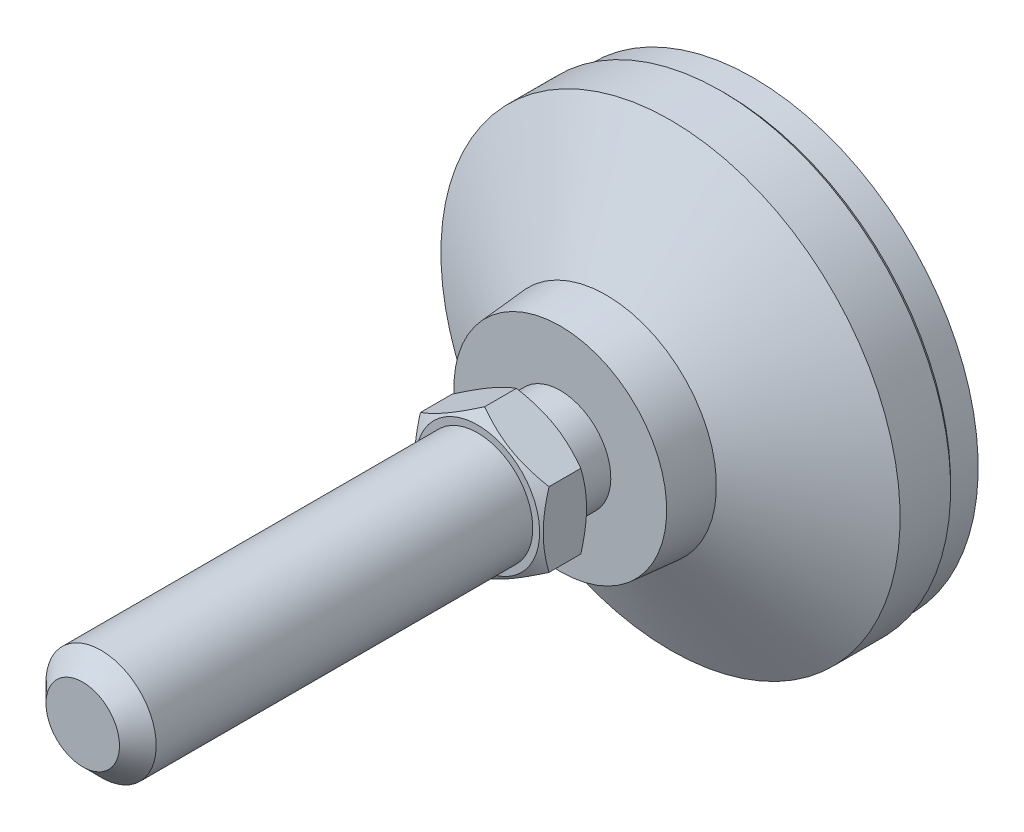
ISO-10303-21;
HEADER;
FILE_DESCRIPTION(('STEP AP214'),'2;1');
FILE_NAME('part.step','',(''),(''),'','','');
FILE_SCHEMA(('AUTOMOTIVE_DESIGN { 1 0 10303 214 1 1 1 1 }'));
ENDSEC;
DATA;
#1=APPLICATION_CONTEXT('core data for automotive mechanical design processes');
#2=APPLICATION_PROTOCOL_DEFINITION('international standard','automotive_design',2000,#1);
#3=PRODUCT_CONTEXT('',#1,'mechanical');
#4=PRODUCT('Part','Part','',(#3));
#5=PRODUCT_RELATED_PRODUCT_CATEGORY('part','',(#4));
#6=PRODUCT_DEFINITION_FORMATION('','',#4);
#7=PRODUCT_DEFINITION_CONTEXT('part definition',#1,'design');
#8=PRODUCT_DEFINITION('design','',#6,#7);
#9=PRODUCT_DEFINITION_SHAPE('','',#8);
#10=(LENGTH_UNIT() NAMED_UNIT(*) SI_UNIT(.MILLI.,.METRE.));
#11=(NAMED_UNIT(*) PLANE_ANGLE_UNIT() SI_UNIT($,.RADIAN.));
#12=(NAMED_UNIT(*) SI_UNIT($,.STERADIAN.) SOLID_ANGLE_UNIT());
#13=UNCERTAINTY_MEASURE_WITH_UNIT(LENGTH_MEASURE(1.E-05),#10,'distance_accuracy_value','');
#14=(GEOMETRIC_REPRESENTATION_CONTEXT(3) GLOBAL_UNCERTAINTY_ASSIGNED_CONTEXT((#13)) GLOBAL_UNIT_ASSIGNED_CONTEXT((#10,
#11,#12)) REPRESENTATION_CONTEXT('',''));
#15=CARTESIAN_POINT('',(0.,0.,0.));
#16=DIRECTION('',(0.,0.,1.));
#17=DIRECTION('',(1.,0.,0.));
#18=AXIS2_PLACEMENT_3D('',#15,#16,#17);
#19=CARTESIAN_POINT('',(0.,0.,1.99999999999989));
#20=DIRECTION('',(0.,0.,-1.));
#21=DIRECTION('',(0.,1.,0.));
#22=AXIS2_PLACEMENT_3D('',#19,#20,#21);
#23=CYLINDRICAL_SURFACE('',#22,5.5);
#24=CARTESIAN_POINT('',(0.,0.,24.9999999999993));
#25=DIRECTION('',(0.,0.,-1.));
#26=DIRECTION('',(0.,1.,0.));
#27=AXIS2_PLACEMENT_3D('',#24,#25,#26);
#28=CIRCLE('',#27,5.5);
#29=CARTESIAN_POINT('',(0.,5.5,24.9999999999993));
#30=VERTEX_POINT('',#29);
#31=EDGE_CURVE('E106',#30,#30,#28,.T.);
#32=ORIENTED_EDGE('',*,*,#31,.T.);
#33=EDGE_LOOP('',(#32));
#34=FACE_BOUND('',#33,.T.);
#35=CARTESIAN_POINT('',(0.,0.,21.));
#36=DIRECTION('',(0.,0.,-1.));
#37=DIRECTION('',(0.,1.,0.));
#38=AXIS2_PLACEMENT_3D('',#35,#36,#37);
#39=CIRCLE('',#38,5.5);
#40=CARTESIAN_POINT('',(0.,5.5,21.));
#41=VERTEX_POINT('',#40);
#42=EDGE_CURVE('E93',#41,#41,#39,.T.);
#43=ORIENTED_EDGE('',*,*,#42,.F.);
#44=EDGE_LOOP('',(#43));
#45=FACE_BOUND('',#44,.T.);
#46=ADVANCED_FACE('F14',(#34,#45),#23,.T.);
#47=CARTESIAN_POINT('',(-5.5,0.,24.9999999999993));
#48=DIRECTION('',(0.,0.,1.));
#49=DIRECTION('',(0.,-1.,0.));
#50=AXIS2_PLACEMENT_3D('',#47,#48,#49);
#51=PLANE('',#50);
#52=CARTESIAN_POINT('',(0.,0.,24.9999999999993));
#53=DIRECTION('',(0.,0.,1.));
#54=DIRECTION('',(0.,-1.,0.));
#55=AXIS2_PLACEMENT_3D('',#52,#53,#54);
#56=CIRCLE('',#55,6.75);
#57=CARTESIAN_POINT('',(0.,-6.75,24.9999999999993));
#58=VERTEX_POINT('',#57);
#59=EDGE_CURVE('E398',#58,#58,#56,.T.);
#60=ORIENTED_EDGE('',*,*,#59,.F.);
#61=EDGE_LOOP('',(#60));
#62=FACE_BOUND('',#61,.T.);
#63=ORIENTED_EDGE('',*,*,#31,.F.);
#64=EDGE_LOOP('',(#63));
#65=FACE_BOUND('',#64,.T.);
#66=ADVANCED_FACE('F143',(#62,#65),#51,.F.);
#67=CARTESIAN_POINT('',(0.,-5.5,21.));
#68=DIRECTION('',(0.,0.,1.));
#69=DIRECTION('',(0.,-1.,0.));
#70=AXIS2_PLACEMENT_3D('',#67,#68,#69);
#71=PLANE('',#70);
#72=ORIENTED_EDGE('',*,*,#42,.T.);
#73=EDGE_LOOP('',(#72));
#74=FACE_BOUND('',#73,.T.);
#75=CARTESIAN_POINT('',(0.,0.,21.));
#76=DIRECTION('',(0.,0.,1.));
#77=DIRECTION('',(0.,-1.,0.));
#78=AXIS2_PLACEMENT_3D('',#75,#76,#77);
#79=CIRCLE('',#78,11.5833333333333);
#80=CARTESIAN_POINT('',(0.,-11.5833333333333,21.));
#81=VERTEX_POINT('',#80);
#82=EDGE_CURVE('E88',#81,#81,#79,.T.);
#83=ORIENTED_EDGE('',*,*,#82,.T.);
#84=EDGE_LOOP('',(#83));
#85=FACE_BOUND('',#84,.T.);
#86=ADVANCED_FACE('F150',(#74,#85),#71,.T.);
#87=CARTESIAN_POINT('',(0.,0.,1.99999999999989));
#88=DIRECTION('',(0.,0.,-1.));
#89=DIRECTION('',(0.,1.,0.));
#90=AXIS2_PLACEMENT_3D('',#87,#88,#89);
#91=CYLINDRICAL_SURFACE('',#90,25.);
#92=CARTESIAN_POINT('',(0.,0.,3.5));
#93=DIRECTION('',(0.,0.,-1.));
#94=DIRECTION('',(0.,1.,0.));
#95=AXIS2_PLACEMENT_3D('',#92,#93,#94);
#96=CIRCLE('',#95,25.);
#97=CARTESIAN_POINT('',(0.,25.,3.5));
#98=VERTEX_POINT('',#97);
#99=EDGE_CURVE('E28',#98,#98,#96,.F.);
#100=ORIENTED_EDGE('',*,*,#99,.T.);
#101=EDGE_LOOP('',(#100));
#102=FACE_BOUND('',#101,.T.);
#103=CARTESIAN_POINT('',(0.,0.,9.));
#104=DIRECTION('',(0.,0.,-1.));
#105=DIRECTION('',(0.,1.,0.));
#106=AXIS2_PLACEMENT_3D('',#103,#104,#105);
#107=CIRCLE('',#106,25.);
#108=CARTESIAN_POINT('',(0.,25.,9.));
#109=VERTEX_POINT('',#108);
#110=EDGE_CURVE('E112',#109,#109,#107,.T.);
#111=ORIENTED_EDGE('',*,*,#110,.T.);
#112=EDGE_LOOP('',(#111));
#113=FACE_BOUND('',#112,.T.);
#114=ADVANCED_FACE('F120',(#102,#113),#91,.T.);
#115=CARTESIAN_POINT('',(0.,0.,16.));
#116=DIRECTION('',(0.,0.,-1.));
#117=DIRECTION('',(0.,1.,0.));
#118=AXIS2_PLACEMENT_3D('',#115,#116,#117);
#119=CONICAL_SURFACE('',#118,11.9999999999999,1.07685495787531);
#120=ORIENTED_EDGE('',*,*,#110,.F.);
#121=EDGE_LOOP('',(#120));
#122=FACE_BOUND('',#121,.T.);
#123=CARTESIAN_POINT('',(0.,0.,16.));
#124=DIRECTION('',(0.,0.,-1.));
#125=DIRECTION('',(0.,1.,0.));
#126=AXIS2_PLACEMENT_3D('',#123,#124,#125);
#127=CIRCLE('',#126,11.9999999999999);
#128=CARTESIAN_POINT('',(0.,11.9999999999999,16.));
#129=VERTEX_POINT('',#128);
#130=EDGE_CURVE('E109',#129,#129,#127,.T.);
#131=ORIENTED_EDGE('',*,*,#130,.T.);
#132=EDGE_LOOP('',(#131));
#133=FACE_BOUND('',#132,.T.);
#134=ADVANCED_FACE('F158',(#122,#133),#119,.T.);
#135=CARTESIAN_POINT('',(0.,0.,22.));
#136=DIRECTION('',(0.,0.,-1.));
#137=DIRECTION('',(0.,1.,0.));
#138=AXIS2_PLACEMENT_3D('',#135,#136,#137);
#139=CONICAL_SURFACE('',#138,11.5,0.0831412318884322);
#140=ORIENTED_EDGE('',*,*,#130,.F.);
#141=EDGE_LOOP('',(#140));
#142=FACE_BOUND('',#141,.T.);
#143=ORIENTED_EDGE('',*,*,#82,.F.);
#144=EDGE_LOOP('',(#143));
#145=FACE_BOUND('',#144,.T.);
#146=ADVANCED_FACE('F126',(#142,#145),#139,.T.);
#147=CARTESIAN_POINT('',(0.,0.,3.));
#148=DIRECTION('',(0.,0.,1.));
#149=DIRECTION('',(0.,-1.,0.));
#150=AXIS2_PLACEMENT_3D('',#147,#148,#149);
#151=CONICAL_SURFACE('',#150,24.5,0.785398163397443);
#152=ORIENTED_EDGE('',*,*,#99,.F.);
#153=EDGE_LOOP('',(#152));
#154=FACE_BOUND('',#153,.T.);
#155=CARTESIAN_POINT('',(0.,0.,3.));
#156=DIRECTION('',(0.,0.,-1.));
#157=DIRECTION('',(0.,1.,0.));
#158=AXIS2_PLACEMENT_3D('',#155,#156,#157);
#159=CIRCLE('',#158,24.5);
#160=CARTESIAN_POINT('',(0.,24.5,3.));
#161=VERTEX_POINT('',#160);
#162=EDGE_CURVE('E114',#161,#161,#159,.T.);
#163=ORIENTED_EDGE('',*,*,#162,.F.);
#164=EDGE_LOOP('',(#163));
#165=FACE_BOUND('',#164,.T.);
#166=ADVANCED_FACE('F16',(#154,#165),#151,.T.);
#167=CARTESIAN_POINT('',(0.,0.,0.));
#168=DIRECTION('',(0.,0.,1.));
#169=DIRECTION('',(0.,-1.,0.));
#170=AXIS2_PLACEMENT_3D('',#167,#168,#169);
#171=CYLINDRICAL_SURFACE('',#170,24.5);
#172=CARTESIAN_POINT('',(0.,0.,0.));
#173=DIRECTION('',(0.,0.,-1.));
#174=DIRECTION('',(0.,1.,0.));
#175=AXIS2_PLACEMENT_3D('',#172,#173,#174);
#176=CIRCLE('',#175,24.5);
#177=CARTESIAN_POINT('',(0.,24.5,0.));
#178=VERTEX_POINT('',#177);
#179=EDGE_CURVE('E264',#178,#178,#176,.T.);
#180=ORIENTED_EDGE('',*,*,#179,.F.);
#181=EDGE_LOOP('',(#180));
#182=FACE_BOUND('',#181,.T.);
#183=ORIENTED_EDGE('',*,*,#162,.T.);
#184=EDGE_LOOP('',(#183));
#185=FACE_BOUND('',#184,.T.);
#186=ADVANCED_FACE('F125',(#182,#185),#171,.T.);
#187=CARTESIAN_POINT('',(0.,0.,0.));
#188=DIRECTION('',(0.,0.,-1.));
#189=DIRECTION('',(0.,1.,0.));
#190=AXIS2_PLACEMENT_3D('',#187,#188,#189);
#191=PLANE('',#190);
#192=ORIENTED_EDGE('',*,*,#179,.T.);
#193=EDGE_LOOP('',(#192));
#194=FACE_BOUND('',#193,.T.);
#195=ADVANCED_FACE('F130',(#194),#191,.T.);
#196=CARTESIAN_POINT('',(0.,0.,24.9999999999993));
#197=DIRECTION('',(0.,0.,1.));
#198=DIRECTION('',(0.,-1.,0.));
#199=AXIS2_PLACEMENT_3D('',#196,#197,#198);
#200=CONICAL_SURFACE('',#199,6.75,1.0471975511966);
#201=CARTESIAN_POINT('',(0.000200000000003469,-8.0830192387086,25.7696190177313));
#202=CARTESIAN_POINT('',(-0.153667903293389,-7.99418356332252,25.7183374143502));
#203=CARTESIAN_POINT('',(-0.308109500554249,-7.90501666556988,25.6693831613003));
#204=CARTESIAN_POINT('',(-0.618246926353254,-7.72595873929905,25.5767703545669));
#205=CARTESIAN_POINT('',(-0.773943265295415,-7.63606741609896,25.5331140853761));
#206=CARTESIAN_POINT('',(-1.24352516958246,-7.36495417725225,25.4109491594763));
#207=CARTESIAN_POINT('',(-1.5592643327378,-7.18266208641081,25.3414631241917));
#208=CARTESIAN_POINT('',(-2.03176224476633,-6.90986528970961,25.2599825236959));
#209=CARTESIAN_POINT('',(-2.18710922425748,-6.82017566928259,25.2367710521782));
#210=CARTESIAN_POINT('',(-2.49850511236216,-6.64039116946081,25.1978487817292));
#211=CARTESIAN_POINT('',(-2.65455395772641,-6.55029632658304,25.1821373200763));
#212=CARTESIAN_POINT('',(-2.96692267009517,-6.36995016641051,25.1586154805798));
#213=CARTESIAN_POINT('',(-3.12324202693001,-6.27969914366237,25.1507961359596));
#214=CARTESIAN_POINT('',(-3.43601650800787,-6.09911871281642,25.1432178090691));
#215=CARTESIAN_POINT('',(-3.59247162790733,-6.00878930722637,25.1434585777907));
#216=CARTESIAN_POINT('',(-4.02110687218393,-5.76131663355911,25.1551972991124));
#217=CARTESIAN_POINT('',(-4.2931466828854,-5.60425437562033,25.1749033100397));
#218=CARTESIAN_POINT('',(-4.83541944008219,-5.29117305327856,25.2373910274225));
#219=CARTESIAN_POINT('',(-5.10565047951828,-5.13515508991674,25.2801940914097));
#220=CARTESIAN_POINT('',(-5.64901454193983,-4.82144370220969,25.3871892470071));
#221=CARTESIAN_POINT('',(-5.92207900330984,-4.6637898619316,25.4518346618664));
#222=CARTESIAN_POINT('',(-6.46413578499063,-4.35083323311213,25.5985536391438));
#223=CARTESIAN_POINT('',(-6.73313504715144,-4.19552643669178,25.6805927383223));
#224=CARTESIAN_POINT('',(-7.0002,-4.04133641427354,25.7696190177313));
#225=B_SPLINE_CURVE_WITH_KNOTS('',3,(#201,#202,#203,#204,#205,#206,#207,#208,#209,#210,#211,
#212,#213,#214,#215,#216,#217,#218,#219,#220,#221,#222,#223,#224),.UNSPECIFIED.,.F.,.F.,(4,2,2,
2,2,2,2,2,2,2,2,4),(0.,0.554727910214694,1.10969417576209,2.2219327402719,2.76443041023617,
3.30688013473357,3.8487128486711,4.39052882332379,5.33376515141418,6.27787517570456,
7.2429241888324,8.20607866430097),.UNSPECIFIED.);
#226=CARTESIAN_POINT('',(0.,-8.08290376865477,25.7695523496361));
#227=VERTEX_POINT('',#226);
#228=CARTESIAN_POINT('',(-7.,-4.04145188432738,25.769552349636));
#229=VERTEX_POINT('',#228);
#230=EDGE_CURVE('E73',#227,#229,#225,.T.);
#231=ORIENTED_EDGE('',*,*,#230,.T.);
#232=CARTESIAN_POINT('',(-7.,10.8630125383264,28.5640080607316));
#233=CARTESIAN_POINT('',(-7.,10.5572155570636,28.4156402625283));
#234=CARTESIAN_POINT('',(-7.,10.2507173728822,28.2686929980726));
#235=CARTESIAN_POINT('',(-7.,9.63594571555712,27.9784383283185));
#236=CARTESIAN_POINT('',(-7.,9.32767197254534,27.8351314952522));
#237=CARTESIAN_POINT('',(-7.,8.70739146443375,27.5522370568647));
#238=CARTESIAN_POINT('',(-7.,8.39537351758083,27.412673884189));
#239=CARTESIAN_POINT('',(-7.,7.76885850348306,27.1392493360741));
#240=CARTESIAN_POINT('',(-7.,7.45436155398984,27.0053876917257));
#241=CARTESIAN_POINT('',(-7.,6.81221025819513,26.7406756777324));
#242=CARTESIAN_POINT('',(-7.,6.4844582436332,26.6100609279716));
#243=CARTESIAN_POINT('',(-7.,5.82512318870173,26.3586994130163));
#244=CARTESIAN_POINT('',(-7.,5.49353972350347,26.2379537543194));
#245=CARTESIAN_POINT('',(-7.,4.82662851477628,26.0094952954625));
#246=CARTESIAN_POINT('',(-7.,4.4913098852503,25.9017561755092));
#247=CARTESIAN_POINT('',(-7.,3.81587463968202,25.7027618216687));
#248=CARTESIAN_POINT('',(-7.,3.47575956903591,25.6115014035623));
#249=CARTESIAN_POINT('',(-7.,2.79237059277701,25.450330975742));
#250=CARTESIAN_POINT('',(-7.,2.44912480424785,25.3803049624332));
#251=CARTESIAN_POINT('',(-7.,1.9311246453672,25.294219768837));
#252=CARTESIAN_POINT('',(-7.,1.75792335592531,25.2686825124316));
#253=CARTESIAN_POINT('',(-7.,1.41065742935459,25.2244266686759));
#254=CARTESIAN_POINT('',(-7.,1.23659287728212,25.205707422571));
#255=CARTESIAN_POINT('',(-7.,0.890110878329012,25.175695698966));
#256=CARTESIAN_POINT('',(-7.,0.7177015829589,25.1643094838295));
#257=CARTESIAN_POINT('',(-7.,0.372555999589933,25.1488383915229));
#258=CARTESIAN_POINT('',(-7.,0.199819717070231,25.1447533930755));
#259=CARTESIAN_POINT('',(-7.,-0.145671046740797,25.143982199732));
#260=CARTESIAN_POINT('',(-7.,-0.318425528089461,25.147296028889));
#261=CARTESIAN_POINT('',(-7.,-0.663641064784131,25.1612414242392));
#262=CARTESIAN_POINT('',(-7.,-0.836102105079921,25.1718733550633));
#263=CARTESIAN_POINT('',(-7.,-1.2503567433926,25.205975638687));
#264=CARTESIAN_POINT('',(-7.,-1.49187154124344,25.232905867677));
#265=CARTESIAN_POINT('',(-7.,-1.97310201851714,25.2996504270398));
#266=CARTESIAN_POINT('',(-7.,-2.21281744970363,25.3394665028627));
#267=CARTESIAN_POINT('',(-7.,-2.92899417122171,25.4761316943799));
#268=CARTESIAN_POINT('',(-7.,-3.40221781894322,25.5901727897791));
#269=CARTESIAN_POINT('',(-7.,-4.10982698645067,25.7878531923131));
#270=CARTESIAN_POINT('',(-7.,-4.34788466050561,25.8591031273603));
#271=CARTESIAN_POINT('',(-7.,-4.82168769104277,26.008984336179));
#272=CARTESIAN_POINT('',(-7.,-5.05743303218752,26.087615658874));
#273=CARTESIAN_POINT('',(-7.,-5.52668595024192,26.2509995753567));
#274=CARTESIAN_POINT('',(-7.,-5.7601942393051,26.3357501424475));
#275=CARTESIAN_POINT('',(-7.,-6.22527733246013,26.5103772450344));
#276=CARTESIAN_POINT('',(-7.,-6.45685215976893,26.6002537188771));
#277=CARTESIAN_POINT('',(-7.,-7.00565643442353,26.8191269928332));
#278=CARTESIAN_POINT('',(-7.,-7.32211612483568,26.950050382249));
#279=CARTESIAN_POINT('',(-7.,-7.952326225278,27.218281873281));
#280=CARTESIAN_POINT('',(-7.,-8.26607646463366,27.3555903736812));
#281=CARTESIAN_POINT('',(-7.,-8.89136965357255,27.6353019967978));
#282=CARTESIAN_POINT('',(-7.,-9.20291213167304,27.7777061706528));
#283=CARTESIAN_POINT('',(-7.,-9.82410849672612,28.0665831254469));
#284=CARTESIAN_POINT('',(-7.,-10.1337623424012,28.2130559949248));
#285=CARTESIAN_POINT('',(-7.,-10.7518223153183,28.5094602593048));
#286=CARTESIAN_POINT('',(-7.,-11.0602267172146,28.6593952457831));
#287=CARTESIAN_POINT('',(-7.,-11.6757024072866,28.9619793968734));
#288=CARTESIAN_POINT('',(-7.,-11.982773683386,29.114628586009));
#289=CARTESIAN_POINT('',(-7.,-12.9022245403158,29.5758799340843));
#290=CARTESIAN_POINT('',(-7.,-13.5129259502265,29.8878268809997));
#291=CARTESIAN_POINT('',(-7.,-14.6795242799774,30.4913100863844));
#292=CARTESIAN_POINT('',(-7.,-15.2356847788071,30.782339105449));
#293=CARTESIAN_POINT('',(-7.,-16.3459435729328,31.3683501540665));
#294=CARTESIAN_POINT('',(-7.,-16.9000417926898,31.6633323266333));
#295=CARTESIAN_POINT('',(-7.,-18.0052310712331,32.2555539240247));
#296=CARTESIAN_POINT('',(-7.,-18.5563261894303,32.5527857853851));
#297=CARTESIAN_POINT('',(-7.,-19.6571994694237,33.1496062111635));
#298=CARTESIAN_POINT('',(-7.,-20.2069777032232,33.4491946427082));
#299=CARTESIAN_POINT('',(-7.,-20.7562720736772,33.7496616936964));
#300=B_SPLINE_CURVE_WITH_KNOTS('',3,(#232,#233,#234,#235,#236,#237,#238,#239,#240,#241,#242,
#243,#244,#245,#246,#247,#248,#249,#250,#251,#252,#253,#254,#255,#256,#257,#258,#259,#260,#261,
#262,#263,#264,#265,#266,#267,#268,#269,#270,#271,#272,#273,#274,#275,#276,#277,#278,#279,#280,
#281,#282,#283,#284,#285,#286,#287,#288,#289,#290,#291,#292,#293,#294,#295,#296,#297,#298,#299),
.UNSPECIFIED.,.F.,.F.,(4,2,2,2,2,2,2,2,2,2,2,2,2,2,2,2,2,2,2,2,2,2,2,2,2,2,2,2,2,2,2,2,2,4),(0.,
1.01968058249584,2.03952046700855,3.06490037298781,4.09023186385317,5.14856701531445,
6.20702066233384,7.26329520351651,8.31923685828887,9.36930142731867,9.89440977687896,
10.4194673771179,10.9376725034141,11.4558690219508,11.974067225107,12.4922912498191,
13.2209144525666,13.9496363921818,15.407884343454,16.1532966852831,16.8987139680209,
17.6438854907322,18.3890480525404,19.4163717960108,20.4437597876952,21.4713609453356,
22.4989844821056,23.5277267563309,24.5564783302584,26.6136989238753,28.4967942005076,
30.3799577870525,32.2583748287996,34.1366867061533),.UNSPECIFIED.);
#301=CARTESIAN_POINT('',(-7.,4.04145188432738,25.769552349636));
#302=VERTEX_POINT('',#301);
#303=EDGE_CURVE('E81',#229,#302,#300,.F.);
#304=ORIENTED_EDGE('',*,*,#303,.T.);
#305=CARTESIAN_POINT('',(-7.0002,4.04133641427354,25.7696190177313));
#306=CARTESIAN_POINT('',(-6.84633209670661,4.13017208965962,25.7183374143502));
#307=CARTESIAN_POINT('',(-6.69189049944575,4.21933898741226,25.6693831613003));
#308=CARTESIAN_POINT('',(-6.38175307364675,4.39839691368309,25.5767703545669));
#309=CARTESIAN_POINT('',(-6.22605673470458,4.48828823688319,25.5331140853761));
#310=CARTESIAN_POINT('',(-5.75647483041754,4.75940147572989,25.4109491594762));
#311=CARTESIAN_POINT('',(-5.4407356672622,4.94169356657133,25.3414631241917));
#312=CARTESIAN_POINT('',(-4.96823775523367,5.21449036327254,25.2599825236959));
#313=CARTESIAN_POINT('',(-4.81289077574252,5.30417998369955,25.2367710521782));
#314=CARTESIAN_POINT('',(-4.50149488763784,5.48396448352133,25.1978487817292));
#315=CARTESIAN_POINT('',(-4.34544604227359,5.57405932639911,25.1821373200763));
#316=CARTESIAN_POINT('',(-4.03307732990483,5.75440548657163,25.1586154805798));
#317=CARTESIAN_POINT('',(-3.87675797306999,5.84465650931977,25.1507961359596));
#318=CARTESIAN_POINT('',(-3.56398349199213,6.02523694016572,25.1432178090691));
#319=CARTESIAN_POINT('',(-3.40752837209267,6.11556634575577,25.1434585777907));
#320=CARTESIAN_POINT('',(-2.97889312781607,6.36303901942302,25.1551972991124));
#321=CARTESIAN_POINT('',(-2.7068533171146,6.52010127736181,25.1749033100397));
#322=CARTESIAN_POINT('',(-2.16458055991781,6.83318259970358,25.2373910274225));
#323=CARTESIAN_POINT('',(-1.89434952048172,6.9892005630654,25.2801940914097));
#324=CARTESIAN_POINT('',(-1.35098545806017,7.30291195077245,25.3871892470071));
#325=CARTESIAN_POINT('',(-1.07792099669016,7.46056579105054,25.4518346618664));
#326=CARTESIAN_POINT('',(-0.535864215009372,7.77352241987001,25.5985536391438));
#327=CARTESIAN_POINT('',(-0.266864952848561,7.92882921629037,25.6805927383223));
#328=CARTESIAN_POINT('',(0.000199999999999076,8.0830192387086,25.7696190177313));
#329=B_SPLINE_CURVE_WITH_KNOTS('',3,(#305,#306,#307,#308,#309,#310,#311,#312,#313,#314,#315,
#316,#317,#318,#319,#320,#321,#322,#323,#324,#325,#326,#327,#328),.UNSPECIFIED.,.F.,.F.,(4,2,2,
2,2,2,2,2,2,2,2,4),(0.,0.554727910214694,1.10969417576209,2.2219327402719,2.76443041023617,
3.30688013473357,3.84871284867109,4.39052882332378,5.33376515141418,6.27787517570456,
7.2429241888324,8.20607866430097),.UNSPECIFIED.);
#330=CARTESIAN_POINT('',(0.,8.08290376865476,25.769552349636));
#331=VERTEX_POINT('',#330);
#332=EDGE_CURVE('E198',#302,#331,#329,.T.);
#333=ORIENTED_EDGE('',*,*,#332,.T.);
#334=CARTESIAN_POINT('',(-0.000200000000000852,8.0830192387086,25.7696190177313));
#335=CARTESIAN_POINT('',(0.15366790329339,7.99418356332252,25.7183374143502));
#336=CARTESIAN_POINT('',(0.308109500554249,7.90501666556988,25.6693831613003));
#337=CARTESIAN_POINT('',(0.618246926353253,7.72595873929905,25.5767703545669));
#338=CARTESIAN_POINT('',(0.773943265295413,7.63606741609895,25.5331140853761));
#339=CARTESIAN_POINT('',(1.24352516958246,7.36495417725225,25.4109491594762));
#340=CARTESIAN_POINT('',(1.5592643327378,7.18266208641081,25.3414631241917));
#341=CARTESIAN_POINT('',(2.03176224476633,6.9098652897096,25.2599825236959));
#342=CARTESIAN_POINT('',(2.18710922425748,6.82017566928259,25.2367710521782));
#343=CARTESIAN_POINT('',(2.49850511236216,6.64039116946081,25.1978487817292));
#344=CARTESIAN_POINT('',(2.6545539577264,6.55029632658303,25.1821373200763));
#345=CARTESIAN_POINT('',(2.96692267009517,6.36995016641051,25.1586154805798));
#346=CARTESIAN_POINT('',(3.12324202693,6.27969914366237,25.1507961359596));
#347=CARTESIAN_POINT('',(3.43601650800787,6.09911871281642,25.1432178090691));
#348=CARTESIAN_POINT('',(3.59247162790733,6.00878930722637,25.1434585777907));
#349=CARTESIAN_POINT('',(4.02110687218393,5.76131663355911,25.1551972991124));
#350=CARTESIAN_POINT('',(4.29314668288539,5.60425437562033,25.1749033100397));
#351=CARTESIAN_POINT('',(4.83541944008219,5.29117305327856,25.2373910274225));
#352=CARTESIAN_POINT('',(5.10565047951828,5.13515508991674,25.2801940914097));
#353=CARTESIAN_POINT('',(5.64901454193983,4.82144370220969,25.3871892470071));
#354=CARTESIAN_POINT('',(5.92207900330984,4.66378986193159,25.4518346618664));
#355=CARTESIAN_POINT('',(6.46413578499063,4.35083323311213,25.5985536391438));
#356=CARTESIAN_POINT('',(6.73313504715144,4.19552643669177,25.6805927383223));
#357=CARTESIAN_POINT('',(7.0002,4.04133641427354,25.7696190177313));
#358=B_SPLINE_CURVE_WITH_KNOTS('',3,(#334,#335,#336,#337,#338,#339,#340,#341,#342,#343,#344,
#345,#346,#347,#348,#349,#350,#351,#352,#353,#354,#355,#356,#357),.UNSPECIFIED.,.F.,.F.,(4,2,2,
2,2,2,2,2,2,2,2,4),(0.,0.554727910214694,1.10969417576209,2.2219327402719,2.76443041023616,
3.30688013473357,3.84871284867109,4.39052882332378,5.33376515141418,6.27787517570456,
7.2429241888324,8.20607866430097),.UNSPECIFIED.);
#359=CARTESIAN_POINT('',(7.,4.04145188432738,25.769552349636));
#360=VERTEX_POINT('',#359);
#361=EDGE_CURVE('E227',#331,#360,#358,.T.);
#362=ORIENTED_EDGE('',*,*,#361,.T.);
#363=CARTESIAN_POINT('',(7.,10.8630125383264,28.5640080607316));
#364=CARTESIAN_POINT('',(7.,10.5572155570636,28.4156402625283));
#365=CARTESIAN_POINT('',(7.,10.2507173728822,28.2686929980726));
#366=CARTESIAN_POINT('',(7.,9.63594571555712,27.9784383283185));
#367=CARTESIAN_POINT('',(7.,9.32767197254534,27.8351314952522));
#368=CARTESIAN_POINT('',(7.,8.70739146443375,27.5522370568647));
#369=CARTESIAN_POINT('',(7.,8.39537351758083,27.412673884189));
#370=CARTESIAN_POINT('',(7.,7.76885850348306,27.1392493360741));
#371=CARTESIAN_POINT('',(7.,7.45436155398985,27.0053876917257));
#372=CARTESIAN_POINT('',(7.,6.81221025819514,26.7406756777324));
#373=CARTESIAN_POINT('',(7.,6.48445824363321,26.6100609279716));
#374=CARTESIAN_POINT('',(7.,5.82512318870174,26.3586994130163));
#375=CARTESIAN_POINT('',(7.,5.49353972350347,26.2379537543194));
#376=CARTESIAN_POINT('',(7.,4.82662851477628,26.0094952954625));
#377=CARTESIAN_POINT('',(7.,4.49130988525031,25.9017561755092));
#378=CARTESIAN_POINT('',(7.,3.81587463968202,25.7027618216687));
#379=CARTESIAN_POINT('',(7.,3.47575956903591,25.6115014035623));
#380=CARTESIAN_POINT('',(7.,2.79237059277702,25.450330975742));
#381=CARTESIAN_POINT('',(7.,2.44912480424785,25.3803049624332));
#382=CARTESIAN_POINT('',(7.,1.93112464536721,25.294219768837));
#383=CARTESIAN_POINT('',(7.,1.75792335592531,25.2686825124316));
#384=CARTESIAN_POINT('',(7.,1.41065742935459,25.2244266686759));
#385=CARTESIAN_POINT('',(7.,1.23659287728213,25.205707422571));
#386=CARTESIAN_POINT('',(7.,0.890110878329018,25.175695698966));
#387=CARTESIAN_POINT('',(7.,0.717701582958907,25.1643094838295));
#388=CARTESIAN_POINT('',(7.,0.37255599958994,25.1488383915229));
#389=CARTESIAN_POINT('',(7.,0.199819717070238,25.1447533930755));
#390=CARTESIAN_POINT('',(7.,-0.145671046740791,25.143982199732));
#391=CARTESIAN_POINT('',(7.,-0.318425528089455,25.147296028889));
#392=CARTESIAN_POINT('',(7.,-0.663641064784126,25.1612414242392));
#393=CARTESIAN_POINT('',(7.,-0.836102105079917,25.1718733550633));
#394=CARTESIAN_POINT('',(7.,-1.25035674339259,25.205975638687));
#395=CARTESIAN_POINT('',(7.,-1.49187154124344,25.232905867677));
#396=CARTESIAN_POINT('',(7.,-1.97310201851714,25.2996504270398));
#397=CARTESIAN_POINT('',(7.,-2.21281744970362,25.3394665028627));
#398=CARTESIAN_POINT('',(7.,-2.92899417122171,25.4761316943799));
#399=CARTESIAN_POINT('',(7.,-3.40221781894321,25.5901727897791));
#400=CARTESIAN_POINT('',(7.,-4.10982698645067,25.7878531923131));
#401=CARTESIAN_POINT('',(7.,-4.3478846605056,25.8591031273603));
#402=CARTESIAN_POINT('',(7.,-4.82168769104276,26.008984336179));
#403=CARTESIAN_POINT('',(7.,-5.05743303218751,26.087615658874));
#404=CARTESIAN_POINT('',(7.,-5.52668595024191,26.2509995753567));
#405=CARTESIAN_POINT('',(7.,-5.76019423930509,26.3357501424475));
#406=CARTESIAN_POINT('',(7.,-6.22527733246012,26.5103772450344));
#407=CARTESIAN_POINT('',(7.,-6.45685215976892,26.6002537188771));
#408=CARTESIAN_POINT('',(7.,-7.00565643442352,26.8191269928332));
#409=CARTESIAN_POINT('',(7.,-7.32211612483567,26.950050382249));
#410=CARTESIAN_POINT('',(7.,-7.95232622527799,27.218281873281));
#411=CARTESIAN_POINT('',(7.,-8.26607646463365,27.3555903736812));
#412=CARTESIAN_POINT('',(7.,-8.89136965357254,27.6353019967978));
#413=CARTESIAN_POINT('',(7.,-9.20291213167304,27.7777061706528));
#414=CARTESIAN_POINT('',(7.,-9.82410849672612,28.0665831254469));
#415=CARTESIAN_POINT('',(7.,-10.1337623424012,28.2130559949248));
#416=CARTESIAN_POINT('',(7.,-10.7518223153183,28.5094602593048));
#417=CARTESIAN_POINT('',(7.,-11.0602267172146,28.6593952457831));
#418=CARTESIAN_POINT('',(7.,-11.6757024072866,28.9619793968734));
#419=CARTESIAN_POINT('',(7.,-11.982773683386,29.114628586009));
#420=CARTESIAN_POINT('',(7.,-12.9022245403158,29.5758799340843));
#421=CARTESIAN_POINT('',(7.,-13.5129259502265,29.8878268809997));
#422=CARTESIAN_POINT('',(7.,-14.6795242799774,30.4913100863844));
#423=CARTESIAN_POINT('',(7.,-15.2356847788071,30.782339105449));
#424=CARTESIAN_POINT('',(7.,-16.3459435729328,31.3683501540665));
#425=CARTESIAN_POINT('',(7.,-16.9000417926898,31.6633323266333));
#426=CARTESIAN_POINT('',(7.,-18.0052310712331,32.2555539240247));
#427=CARTESIAN_POINT('',(7.,-18.5563261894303,32.5527857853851));
#428=CARTESIAN_POINT('',(7.,-19.6571994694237,33.1496062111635));
#429=CARTESIAN_POINT('',(7.,-20.2069777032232,33.4491946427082));
#430=CARTESIAN_POINT('',(7.,-20.7562720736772,33.7496616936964));
#431=B_SPLINE_CURVE_WITH_KNOTS('',3,(#363,#364,#365,#366,#367,#368,#369,#370,#371,#372,#373,
#374,#375,#376,#377,#378,#379,#380,#381,#382,#383,#384,#385,#386,#387,#388,#389,#390,#391,#392,
#393,#394,#395,#396,#397,#398,#399,#400,#401,#402,#403,#404,#405,#406,#407,#408,#409,#410,#411,
#412,#413,#414,#415,#416,#417,#418,#419,#420,#421,#422,#423,#424,#425,#426,#427,#428,#429,#430),
.UNSPECIFIED.,.F.,.F.,(4,2,2,2,2,2,2,2,2,2,2,2,2,2,2,2,2,2,2,2,2,2,2,2,2,2,2,2,2,2,2,2,2,4),(0.,
1.01968058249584,2.03952046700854,3.06490037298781,4.09023186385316,5.14856701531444,
6.20702066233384,7.2632952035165,8.31923685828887,9.36930142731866,9.89440977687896,
10.4194673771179,10.9376725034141,11.4558690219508,11.974067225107,12.4922912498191,
13.2209144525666,13.9496363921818,15.407884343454,16.1532966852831,16.8987139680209,
17.6438854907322,18.3890480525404,19.4163717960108,20.4437597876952,21.4713609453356,
22.4989844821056,23.5277267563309,24.5564783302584,26.6136989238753,28.4967942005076,
30.3799577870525,32.2583748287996,34.1366867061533),.UNSPECIFIED.);
#432=CARTESIAN_POINT('',(7.,-4.04145188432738,25.769552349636));
#433=VERTEX_POINT('',#432);
#434=EDGE_CURVE('E34',#360,#433,#431,.T.);
#435=ORIENTED_EDGE('',*,*,#434,.T.);
#436=CARTESIAN_POINT('',(7.0002,-4.04133641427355,25.7696190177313));
#437=CARTESIAN_POINT('',(6.84633209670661,-4.13017208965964,25.7183374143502));
#438=CARTESIAN_POINT('',(6.69189049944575,-4.21933898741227,25.6693831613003));
#439=CARTESIAN_POINT('',(6.38175307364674,-4.3983969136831,25.5767703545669));
#440=CARTESIAN_POINT('',(6.22605673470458,-4.4882882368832,25.5331140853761));
#441=CARTESIAN_POINT('',(5.75647483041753,-4.7594014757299,25.4109491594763));
#442=CARTESIAN_POINT('',(5.4407356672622,-4.94169356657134,25.3414631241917));
#443=CARTESIAN_POINT('',(4.96823775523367,-5.21449036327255,25.2599825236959));
#444=CARTESIAN_POINT('',(4.81289077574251,-5.30417998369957,25.2367710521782));
#445=CARTESIAN_POINT('',(4.50149488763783,-5.48396448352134,25.1978487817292));
#446=CARTESIAN_POINT('',(4.34544604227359,-5.57405932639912,25.1821373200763));
#447=CARTESIAN_POINT('',(4.03307732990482,-5.75440548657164,25.1586154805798));
#448=CARTESIAN_POINT('',(3.87675797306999,-5.84465650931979,25.1507961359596));
#449=CARTESIAN_POINT('',(3.56398349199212,-6.02523694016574,25.1432178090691));
#450=CARTESIAN_POINT('',(3.40752837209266,-6.11556634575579,25.1434585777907));
#451=CARTESIAN_POINT('',(2.97889312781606,-6.36303901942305,25.1551972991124));
#452=CARTESIAN_POINT('',(2.7068533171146,-6.52010127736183,25.1749033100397));
#453=CARTESIAN_POINT('',(2.1645805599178,-6.8331825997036,25.2373910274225));
#454=CARTESIAN_POINT('',(1.89434952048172,-6.98920056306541,25.2801940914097));
#455=CARTESIAN_POINT('',(1.35098545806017,-7.30291195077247,25.3871892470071));
#456=CARTESIAN_POINT('',(1.07792099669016,-7.46056579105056,25.4518346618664));
#457=CARTESIAN_POINT('',(0.535864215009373,-7.77352241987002,25.5985536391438));
#458=CARTESIAN_POINT('',(0.266864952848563,-7.92882921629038,25.6805927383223));
#459=CARTESIAN_POINT('',(-0.00019999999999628,-8.08301923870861,25.7696190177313));
#460=B_SPLINE_CURVE_WITH_KNOTS('',3,(#436,#437,#438,#439,#440,#441,#442,#443,#444,#445,#446,
#447,#448,#449,#450,#451,#452,#453,#454,#455,#456,#457,#458,#459),.UNSPECIFIED.,.F.,.F.,(4,2,2,
2,2,2,2,2,2,2,2,4),(0.,0.554727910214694,1.10969417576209,2.2219327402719,2.76443041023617,
3.30688013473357,3.8487128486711,4.39052882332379,5.33376515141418,6.27787517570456,
7.24292418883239,8.20607866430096),.UNSPECIFIED.);
#461=EDGE_CURVE('E9',#433,#227,#460,.T.);
#462=ORIENTED_EDGE('',*,*,#461,.T.);
#463=EDGE_LOOP('',(#231,#304,#333,#362,#435,#462));
#464=FACE_BOUND('',#463,.T.);
#465=ORIENTED_EDGE('',*,*,#59,.T.);
#466=EDGE_LOOP('',(#465));
#467=FACE_BOUND('',#466,.T.);
#468=ADVANCED_FACE('F71',(#464,#467),#200,.T.);
#469=CARTESIAN_POINT('',(-3.9999999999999,0.,73.));
#470=DIRECTION('',(0.,0.,-1.));
#471=DIRECTION('',(0.,1.,0.));
#472=AXIS2_PLACEMENT_3D('',#469,#470,#471);
#473=PLANE('',#472);
#474=CARTESIAN_POINT('',(0.,0.,73.));
#475=DIRECTION('',(0.,0.,-1.));
#476=DIRECTION('',(0.,1.,0.));
#477=AXIS2_PLACEMENT_3D('',#474,#475,#476);
#478=CIRCLE('',#477,3.9999999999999);
#479=CARTESIAN_POINT('',(0.,3.9999999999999,73.));
#480=VERTEX_POINT('',#479);
#481=EDGE_CURVE('E97',#480,#480,#478,.T.);
#482=ORIENTED_EDGE('',*,*,#481,.F.);
#483=EDGE_LOOP('',(#482));
#484=FACE_BOUND('',#483,.T.);
#485=ADVANCED_FACE('F212',(#484),#473,.F.);
#486=CARTESIAN_POINT('',(0.,0.,73.));
#487=DIRECTION('',(0.,0.,-1.));
#488=DIRECTION('',(0.,1.,0.));
#489=AXIS2_PLACEMENT_3D('',#486,#487,#488);
#490=CONICAL_SURFACE('',#489,3.9999999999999,0.785398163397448);
#491=CARTESIAN_POINT('',(0.,0.,71.));
#492=DIRECTION('',(0.,0.,-1.));
#493=DIRECTION('',(0.,1.,0.));
#494=AXIS2_PLACEMENT_3D('',#491,#492,#493);
#495=CIRCLE('',#494,5.99999999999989);
#496=CARTESIAN_POINT('',(0.,5.99999999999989,71.));
#497=VERTEX_POINT('',#496);
#498=EDGE_CURVE('E100',#497,#497,#495,.T.);
#499=ORIENTED_EDGE('',*,*,#498,.F.);
#500=EDGE_LOOP('',(#499));
#501=FACE_BOUND('',#500,.T.);
#502=ORIENTED_EDGE('',*,*,#481,.T.);
#503=EDGE_LOOP('',(#502));
#504=FACE_BOUND('',#503,.T.);
#505=ADVANCED_FACE('F279',(#501,#504),#490,.T.);
#506=CARTESIAN_POINT('',(0.,0.,1.99999999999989));
#507=DIRECTION('',(0.,0.,-1.));
#508=DIRECTION('',(0.,1.,0.));
#509=AXIS2_PLACEMENT_3D('',#506,#507,#508);
#510=CYLINDRICAL_SURFACE('',#509,5.99999999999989);
#511=CARTESIAN_POINT('',(0.,0.,29.9999999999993));
#512=DIRECTION('',(0.,0.,-1.));
#513=DIRECTION('',(0.,1.,0.));
#514=AXIS2_PLACEMENT_3D('',#511,#512,#513);
#515=CIRCLE('',#514,5.99999999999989);
#516=CARTESIAN_POINT('',(0.,5.99999999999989,29.9999999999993));
#517=VERTEX_POINT('',#516);
#518=EDGE_CURVE('E103',#517,#517,#515,.T.);
#519=ORIENTED_EDGE('',*,*,#518,.F.);
#520=EDGE_LOOP('',(#519));
#521=FACE_BOUND('',#520,.T.);
#522=ORIENTED_EDGE('',*,*,#498,.T.);
#523=EDGE_LOOP('',(#522));
#524=FACE_BOUND('',#523,.T.);
#525=ADVANCED_FACE('F283',(#521,#524),#510,.T.);
#526=CARTESIAN_POINT('',(-5.99999999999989,0.,29.9999999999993));
#527=DIRECTION('',(0.,0.,-1.));
#528=DIRECTION('',(0.,1.,0.));
#529=AXIS2_PLACEMENT_3D('',#526,#527,#528);
#530=PLANE('',#529);
#531=CARTESIAN_POINT('',(0.,0.,29.9999999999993));
#532=DIRECTION('',(0.,0.,1.));
#533=DIRECTION('',(0.,-1.,0.));
#534=AXIS2_PLACEMENT_3D('',#531,#532,#533);
#535=CIRCLE('',#534,6.75);
#536=CARTESIAN_POINT('',(0.,-6.75,29.9999999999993));
#537=VERTEX_POINT('',#536);
#538=EDGE_CURVE('E80',#537,#537,#535,.T.);
#539=ORIENTED_EDGE('',*,*,#538,.T.);
#540=EDGE_LOOP('',(#539));
#541=FACE_BOUND('',#540,.T.);
#542=ORIENTED_EDGE('',*,*,#518,.T.);
#543=EDGE_LOOP('',(#542));
#544=FACE_BOUND('',#543,.T.);
#545=ADVANCED_FACE('F286',(#541,#544),#530,.F.);
#546=CARTESIAN_POINT('',(0.,0.,28.0492317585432));
#547=DIRECTION('',(0.,0.,-1.));
#548=DIRECTION('',(0.,1.,0.));
#549=AXIS2_PLACEMENT_3D('',#546,#547,#548);
#550=CONICAL_SURFACE('',#549,10.1288297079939,1.0471975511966);
#551=CARTESIAN_POINT('',(-7.0002,-4.04133641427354,29.2303809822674));
#552=CARTESIAN_POINT('',(-6.84633209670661,-4.13017208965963,29.2816625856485));
#553=CARTESIAN_POINT('',(-6.69189049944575,-4.21933898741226,29.3306168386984));
#554=CARTESIAN_POINT('',(-6.38175307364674,-4.3983969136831,29.4232296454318));
#555=CARTESIAN_POINT('',(-6.22605673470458,-4.48828823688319,29.4668859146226));
#556=CARTESIAN_POINT('',(-5.75647483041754,-4.7594014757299,29.5890508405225));
#557=CARTESIAN_POINT('',(-5.4407356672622,-4.94169356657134,29.658536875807));
#558=CARTESIAN_POINT('',(-4.96823775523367,-5.21449036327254,29.7400174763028));
#559=CARTESIAN_POINT('',(-4.81289077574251,-5.30417998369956,29.7632289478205));
#560=CARTESIAN_POINT('',(-4.50149488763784,-5.48396448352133,29.8021512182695));
#561=CARTESIAN_POINT('',(-4.34544604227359,-5.57405932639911,29.8178626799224));
#562=CARTESIAN_POINT('',(-4.03307732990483,-5.75440548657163,29.8413845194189));
#563=CARTESIAN_POINT('',(-3.87675797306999,-5.84465650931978,29.8492038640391));
#564=CARTESIAN_POINT('',(-3.56398349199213,-6.02523694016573,29.8567821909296));
#565=CARTESIAN_POINT('',(-3.40752837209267,-6.11556634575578,29.856541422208));
#566=CARTESIAN_POINT('',(-2.97889312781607,-6.36303901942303,29.8448027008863));
#567=CARTESIAN_POINT('',(-2.7068533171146,-6.52010127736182,29.825096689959));
#568=CARTESIAN_POINT('',(-2.1645805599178,-6.83318259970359,29.7626089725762));
#569=CARTESIAN_POINT('',(-1.89434952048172,-6.9892005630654,29.719805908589));
#570=CARTESIAN_POINT('',(-1.35098545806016,-7.30291195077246,29.6128107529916));
#571=CARTESIAN_POINT('',(-1.07792099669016,-7.46056579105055,29.5481653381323));
#572=CARTESIAN_POINT('',(-0.53586421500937,-7.77352241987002,29.4014463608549));
#573=CARTESIAN_POINT('',(-0.266864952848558,-7.92882921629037,29.3194072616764));
#574=CARTESIAN_POINT('',(0.000200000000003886,-8.0830192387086,29.2303809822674));
#575=B_SPLINE_CURVE_WITH_KNOTS('',3,(#551,#552,#553,#554,#555,#556,#557,#558,#559,#560,#561,
#562,#563,#564,#565,#566,#567,#568,#569,#570,#571,#572,#573,#574),.UNSPECIFIED.,.F.,.F.,(4,2,2,
2,2,2,2,2,2,2,2,4),(0.,0.554727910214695,1.10969417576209,2.2219327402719,2.76443041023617,
3.30688013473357,3.8487128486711,4.39052882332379,5.33376515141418,6.27787517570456,
7.2429241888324,8.20607866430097),.UNSPECIFIED.);
#576=CARTESIAN_POINT('',(-7.,-4.04145188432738,29.2304476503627));
#577=VERTEX_POINT('',#576);
#578=CARTESIAN_POINT('',(0.,-8.08290376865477,29.2304476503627));
#579=VERTEX_POINT('',#578);
#580=EDGE_CURVE('E263',#577,#579,#575,.T.);
#581=ORIENTED_EDGE('',*,*,#580,.T.);
#582=CARTESIAN_POINT('',(-0.000199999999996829,-8.08301923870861,29.2303809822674));
#583=CARTESIAN_POINT('',(0.153667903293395,-7.99418356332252,29.2816625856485));
#584=CARTESIAN_POINT('',(0.308109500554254,-7.90501666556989,29.3306168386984));
#585=CARTESIAN_POINT('',(0.618246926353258,-7.72595873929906,29.4232296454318));
#586=CARTESIAN_POINT('',(0.773943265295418,-7.63606741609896,29.4668859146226));
#587=CARTESIAN_POINT('',(1.24352516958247,-7.36495417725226,29.5890508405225));
#588=CARTESIAN_POINT('',(1.5592643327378,-7.18266208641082,29.658536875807));
#589=CARTESIAN_POINT('',(2.03176224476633,-6.90986528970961,29.7400174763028));
#590=CARTESIAN_POINT('',(2.18710922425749,-6.8201756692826,29.7632289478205));
#591=CARTESIAN_POINT('',(2.49850511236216,-6.64039116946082,29.8021512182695));
#592=CARTESIAN_POINT('',(2.65455395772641,-6.55029632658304,29.8178626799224));
#593=CARTESIAN_POINT('',(2.96692267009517,-6.36995016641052,29.8413845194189));
#594=CARTESIAN_POINT('',(3.12324202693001,-6.27969914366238,29.8492038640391));
#595=CARTESIAN_POINT('',(3.43601650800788,-6.09911871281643,29.8567821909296));
#596=CARTESIAN_POINT('',(3.59247162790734,-6.00878930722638,29.856541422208));
#597=CARTESIAN_POINT('',(4.02110687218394,-5.76131663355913,29.8448027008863));
#598=CARTESIAN_POINT('',(4.2931466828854,-5.60425437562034,29.825096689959));
#599=CARTESIAN_POINT('',(4.8354194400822,-5.29117305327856,29.7626089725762));
#600=CARTESIAN_POINT('',(5.10565047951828,-5.13515508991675,29.719805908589));
#601=CARTESIAN_POINT('',(5.64901454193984,-4.8214437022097,29.6128107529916));
#602=CARTESIAN_POINT('',(5.92207900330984,-4.66378986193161,29.5481653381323));
#603=CARTESIAN_POINT('',(6.46413578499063,-4.35083323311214,29.4014463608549));
#604=CARTESIAN_POINT('',(6.73313504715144,-4.19552643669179,29.3194072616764));
#605=CARTESIAN_POINT('',(7.0002,-4.04133641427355,29.2303809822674));
#606=B_SPLINE_CURVE_WITH_KNOTS('',3,(#582,#583,#584,#585,#586,#587,#588,#589,#590,#591,#592,
#593,#594,#595,#596,#597,#598,#599,#600,#601,#602,#603,#604,#605),.UNSPECIFIED.,.F.,.F.,(4,2,2,
2,2,2,2,2,2,2,2,4),(0.,0.554727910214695,1.10969417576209,2.2219327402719,2.76443041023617,
3.30688013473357,3.8487128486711,4.39052882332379,5.33376515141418,6.27787517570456,
7.24292418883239,8.20607866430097),.UNSPECIFIED.);
#607=CARTESIAN_POINT('',(7.,-4.04145188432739,29.2304476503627));
#608=VERTEX_POINT('',#607);
#609=EDGE_CURVE('E86',#579,#608,#606,.T.);
#610=ORIENTED_EDGE('',*,*,#609,.T.);
#611=CARTESIAN_POINT('',(7.,10.8630125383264,26.4359919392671));
#612=CARTESIAN_POINT('',(7.,10.5572155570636,26.5843597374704));
#613=CARTESIAN_POINT('',(7.,10.2507173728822,26.7313070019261));
#614=CARTESIAN_POINT('',(7.,9.63594571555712,27.0215616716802));
#615=CARTESIAN_POINT('',(7.,9.32767197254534,27.1648685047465));
#616=CARTESIAN_POINT('',(7.,8.70739146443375,27.4477629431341));
#617=CARTESIAN_POINT('',(7.,8.39537351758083,27.5873261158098));
#618=CARTESIAN_POINT('',(7.,7.76885850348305,27.8607506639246));
#619=CARTESIAN_POINT('',(7.,7.45436155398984,27.994612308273));
#620=CARTESIAN_POINT('',(7.,6.81221025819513,28.2593243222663));
#621=CARTESIAN_POINT('',(7.,6.4844582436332,28.3899390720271));
#622=CARTESIAN_POINT('',(7.,5.82512318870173,28.6413005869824));
#623=CARTESIAN_POINT('',(7.,5.49353972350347,28.7620462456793));
#624=CARTESIAN_POINT('',(7.,4.82662851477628,28.9905047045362));
#625=CARTESIAN_POINT('',(7.,4.49130988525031,29.0982438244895));
#626=CARTESIAN_POINT('',(7.,3.81587463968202,29.29723817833));
#627=CARTESIAN_POINT('',(7.,3.47575956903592,29.3884985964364));
#628=CARTESIAN_POINT('',(7.,2.79237059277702,29.5496690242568));
#629=CARTESIAN_POINT('',(7.,2.44912480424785,29.6196950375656));
#630=CARTESIAN_POINT('',(7.,1.93112464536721,29.7057802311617));
#631=CARTESIAN_POINT('',(7.,1.75792335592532,29.7313174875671));
#632=CARTESIAN_POINT('',(7.,1.41065742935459,29.7755733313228));
#633=CARTESIAN_POINT('',(7.,1.23659287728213,29.7942925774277));
#634=CARTESIAN_POINT('',(7.,0.890110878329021,29.8243043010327));
#635=CARTESIAN_POINT('',(7.,0.717701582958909,29.8356905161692));
#636=CARTESIAN_POINT('',(7.,0.372555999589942,29.8511616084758));
#637=CARTESIAN_POINT('',(7.,0.19981971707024,29.8552466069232));
#638=CARTESIAN_POINT('',(7.,-0.145671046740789,29.8560178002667));
#639=CARTESIAN_POINT('',(7.,-0.318425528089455,29.8527039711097));
#640=CARTESIAN_POINT('',(7.,-0.663641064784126,29.8387585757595));
#641=CARTESIAN_POINT('',(7.,-0.836102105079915,29.8281266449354));
#642=CARTESIAN_POINT('',(7.,-1.2503567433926,29.7940243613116));
#643=CARTESIAN_POINT('',(7.,-1.49187154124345,29.7670941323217));
#644=CARTESIAN_POINT('',(7.,-1.97310201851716,29.700349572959));
#645=CARTESIAN_POINT('',(7.,-2.21281744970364,29.6605334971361));
#646=CARTESIAN_POINT('',(7.,-2.92899417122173,29.5238683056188));
#647=CARTESIAN_POINT('',(7.,-3.40221781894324,29.4098272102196));
#648=CARTESIAN_POINT('',(7.,-4.1098269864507,29.2121468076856));
#649=CARTESIAN_POINT('',(7.,-4.34788466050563,29.1408968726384));
#650=CARTESIAN_POINT('',(7.,-4.82168769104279,28.9910156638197));
#651=CARTESIAN_POINT('',(7.,-5.05743303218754,28.9123843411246));
#652=CARTESIAN_POINT('',(7.,-5.52668595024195,28.749000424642));
#653=CARTESIAN_POINT('',(7.,-5.76019423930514,28.6642498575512));
#654=CARTESIAN_POINT('',(7.,-6.22527733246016,28.4896227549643));
#655=CARTESIAN_POINT('',(7.,-6.45685215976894,28.3997462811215));
#656=CARTESIAN_POINT('',(7.,-7.00565643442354,28.1808730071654));
#657=CARTESIAN_POINT('',(7.,-7.32211612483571,28.0499496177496));
#658=CARTESIAN_POINT('',(7.,-7.95232622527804,27.7817181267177));
#659=CARTESIAN_POINT('',(7.,-8.2660764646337,27.6444096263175));
#660=CARTESIAN_POINT('',(7.,-8.89136965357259,27.3646980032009));
#661=CARTESIAN_POINT('',(7.,-9.20291213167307,27.2222938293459));
#662=CARTESIAN_POINT('',(7.,-9.82410849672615,26.9334168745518));
#663=CARTESIAN_POINT('',(7.,-10.1337623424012,26.7869440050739));
#664=CARTESIAN_POINT('',(7.,-10.7518223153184,26.4905397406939));
#665=CARTESIAN_POINT('',(7.,-11.0602267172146,26.3406047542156));
#666=CARTESIAN_POINT('',(7.,-11.6757024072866,26.0380206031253));
#667=CARTESIAN_POINT('',(7.,-11.982773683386,25.8853714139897));
#668=CARTESIAN_POINT('',(7.,-12.9022245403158,25.4241200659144));
#669=CARTESIAN_POINT('',(7.,-13.5129259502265,25.112173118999));
#670=CARTESIAN_POINT('',(7.,-14.6795242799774,24.5086899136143));
#671=CARTESIAN_POINT('',(7.,-15.2356847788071,24.2176608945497));
#672=CARTESIAN_POINT('',(7.,-16.3459435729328,23.6316498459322));
#673=CARTESIAN_POINT('',(7.,-16.9000417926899,23.3366676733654));
#674=CARTESIAN_POINT('',(7.,-18.0052310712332,22.744446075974));
#675=CARTESIAN_POINT('',(7.,-18.5563261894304,22.4472142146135));
#676=CARTESIAN_POINT('',(7.,-19.6571994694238,21.8503937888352));
#677=CARTESIAN_POINT('',(7.,-20.2069777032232,21.5508053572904));
#678=CARTESIAN_POINT('',(7.,-20.7562720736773,21.2503383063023));
#679=B_SPLINE_CURVE_WITH_KNOTS('',3,(#611,#612,#613,#614,#615,#616,#617,#618,#619,#620,#621,
#622,#623,#624,#625,#626,#627,#628,#629,#630,#631,#632,#633,#634,#635,#636,#637,#638,#639,#640,
#641,#642,#643,#644,#645,#646,#647,#648,#649,#650,#651,#652,#653,#654,#655,#656,#657,#658,#659,
#660,#661,#662,#663,#664,#665,#666,#667,#668,#669,#670,#671,#672,#673,#674,#675,#676,#677,#678),
.UNSPECIFIED.,.F.,.F.,(4,2,2,2,2,2,2,2,2,2,2,2,2,2,2,2,2,2,2,2,2,2,2,2,2,2,2,2,2,2,2,2,2,4),(0.,
1.01968058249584,2.03952046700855,3.06490037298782,4.09023186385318,5.14856701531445,
6.20702066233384,7.2632952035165,8.31923685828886,9.36930142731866,9.89440977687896,
10.4194673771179,10.937672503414,11.4558690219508,11.974067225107,12.4922912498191,
13.2209144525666,13.9496363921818,15.407884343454,16.1532966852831,16.8987139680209,
17.6438854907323,18.3890480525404,19.4163717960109,20.4437597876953,21.4713609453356,
22.4989844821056,23.5277267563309,24.5564783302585,26.6136989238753,28.4967942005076,
30.3799577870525,32.2583748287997,34.1366867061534),.UNSPECIFIED.);
#680=CARTESIAN_POINT('',(7.,4.04145188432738,29.2304476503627));
#681=VERTEX_POINT('',#680);
#682=EDGE_CURVE('E248',#608,#681,#679,.F.);
#683=ORIENTED_EDGE('',*,*,#682,.T.);
#684=CARTESIAN_POINT('',(7.0002,4.04133641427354,29.2303809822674));
#685=CARTESIAN_POINT('',(6.84633209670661,4.13017208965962,29.2816625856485));
#686=CARTESIAN_POINT('',(6.69189049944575,4.21933898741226,29.3306168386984));
#687=CARTESIAN_POINT('',(6.38175307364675,4.39839691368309,29.4232296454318));
#688=CARTESIAN_POINT('',(6.22605673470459,4.48828823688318,29.4668859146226));
#689=CARTESIAN_POINT('',(5.75647483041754,4.75940147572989,29.5890508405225));
#690=CARTESIAN_POINT('',(5.4407356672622,4.94169356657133,29.658536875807));
#691=CARTESIAN_POINT('',(4.96823775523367,5.21449036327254,29.7400174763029));
#692=CARTESIAN_POINT('',(4.81289077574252,5.30417998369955,29.7632289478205));
#693=CARTESIAN_POINT('',(4.50149488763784,5.48396448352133,29.8021512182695));
#694=CARTESIAN_POINT('',(4.3454460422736,5.57405932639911,29.8178626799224));
#695=CARTESIAN_POINT('',(4.03307732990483,5.75440548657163,29.8413845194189));
#696=CARTESIAN_POINT('',(3.87675797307,5.84465650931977,29.8492038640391));
#697=CARTESIAN_POINT('',(3.56398349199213,6.02523694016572,29.8567821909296));
#698=CARTESIAN_POINT('',(3.40752837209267,6.11556634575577,29.856541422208));
#699=CARTESIAN_POINT('',(2.97889312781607,6.36303901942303,29.8448027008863));
#700=CARTESIAN_POINT('',(2.70685331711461,6.52010127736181,29.825096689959));
#701=CARTESIAN_POINT('',(2.16458055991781,6.83318259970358,29.7626089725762));
#702=CARTESIAN_POINT('',(1.89434952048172,6.9892005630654,29.719805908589));
#703=CARTESIAN_POINT('',(1.35098545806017,7.30291195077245,29.6128107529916));
#704=CARTESIAN_POINT('',(1.07792099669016,7.46056579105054,29.5481653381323));
#705=CARTESIAN_POINT('',(0.535864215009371,7.77352241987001,29.4014463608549));
#706=CARTESIAN_POINT('',(0.266864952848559,7.92882921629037,29.3194072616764));
#707=CARTESIAN_POINT('',(-0.000200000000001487,8.0830192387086,29.2303809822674));
#708=B_SPLINE_CURVE_WITH_KNOTS('',3,(#684,#685,#686,#687,#688,#689,#690,#691,#692,#693,#694,
#695,#696,#697,#698,#699,#700,#701,#702,#703,#704,#705,#706,#707),.UNSPECIFIED.,.F.,.F.,(4,2,2,
2,2,2,2,2,2,2,2,4),(0.,0.554727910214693,1.10969417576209,2.2219327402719,2.76443041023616,
3.30688013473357,3.84871284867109,4.39052882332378,5.33376515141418,6.27787517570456,
7.2429241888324,8.20607866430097),.UNSPECIFIED.);
#709=CARTESIAN_POINT('',(0.,8.08290376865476,29.2304476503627));
#710=VERTEX_POINT('',#709);
#711=EDGE_CURVE('E240',#681,#710,#708,.T.);
#712=ORIENTED_EDGE('',*,*,#711,.T.);
#713=CARTESIAN_POINT('',(0.000199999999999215,8.0830192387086,29.2303809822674));
#714=CARTESIAN_POINT('',(-0.153667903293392,7.99418356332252,29.2816625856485));
#715=CARTESIAN_POINT('',(-0.30810950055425,7.90501666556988,29.3306168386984));
#716=CARTESIAN_POINT('',(-0.618246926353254,7.72595873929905,29.4232296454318));
#717=CARTESIAN_POINT('',(-0.773943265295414,7.63606741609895,29.4668859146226));
#718=CARTESIAN_POINT('',(-1.24352516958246,7.36495417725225,29.5890508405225));
#719=CARTESIAN_POINT('',(-1.5592643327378,7.18266208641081,29.658536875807));
#720=CARTESIAN_POINT('',(-2.03176224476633,6.9098652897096,29.7400174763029));
#721=CARTESIAN_POINT('',(-2.18710922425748,6.82017566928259,29.7632289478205));
#722=CARTESIAN_POINT('',(-2.49850511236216,6.64039116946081,29.8021512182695));
#723=CARTESIAN_POINT('',(-2.65455395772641,6.55029632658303,29.8178626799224));
#724=CARTESIAN_POINT('',(-2.96692267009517,6.36995016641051,29.8413845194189));
#725=CARTESIAN_POINT('',(-3.12324202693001,6.27969914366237,29.8492038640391));
#726=CARTESIAN_POINT('',(-3.43601650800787,6.09911871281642,29.8567821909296));
#727=CARTESIAN_POINT('',(-3.59247162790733,6.00878930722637,29.856541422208));
#728=CARTESIAN_POINT('',(-4.02110687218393,5.76131663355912,29.8448027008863));
#729=CARTESIAN_POINT('',(-4.2931466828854,5.60425437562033,29.825096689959));
#730=CARTESIAN_POINT('',(-4.8354194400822,5.29117305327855,29.7626089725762));
#731=CARTESIAN_POINT('',(-5.10565047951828,5.13515508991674,29.719805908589));
#732=CARTESIAN_POINT('',(-5.64901454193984,4.82144370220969,29.6128107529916));
#733=CARTESIAN_POINT('',(-5.92207900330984,4.66378986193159,29.5481653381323));
#734=CARTESIAN_POINT('',(-6.46413578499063,4.35083323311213,29.4014463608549));
#735=CARTESIAN_POINT('',(-6.73313504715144,4.19552643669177,29.3194072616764));
#736=CARTESIAN_POINT('',(-7.0002,4.04133641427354,29.2303809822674));
#737=B_SPLINE_CURVE_WITH_KNOTS('',3,(#713,#714,#715,#716,#717,#718,#719,#720,#721,#722,#723,
#724,#725,#726,#727,#728,#729,#730,#731,#732,#733,#734,#735,#736),.UNSPECIFIED.,.F.,.F.,(4,2,2,
2,2,2,2,2,2,2,2,4),(0.,0.554727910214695,1.10969417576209,2.2219327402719,2.76443041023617,
3.30688013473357,3.8487128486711,4.39052882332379,5.33376515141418,6.27787517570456,
7.2429241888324,8.20607866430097),.UNSPECIFIED.);
#738=CARTESIAN_POINT('',(-7.,4.04145188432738,29.2304476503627));
#739=VERTEX_POINT('',#738);
#740=EDGE_CURVE('E247',#710,#739,#737,.T.);
#741=ORIENTED_EDGE('',*,*,#740,.T.);
#742=CARTESIAN_POINT('',(-7.,10.8630125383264,26.4359919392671));
#743=CARTESIAN_POINT('',(-7.,10.5572155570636,26.5843597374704));
#744=CARTESIAN_POINT('',(-7.,10.2507173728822,26.7313070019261));
#745=CARTESIAN_POINT('',(-7.,9.63594571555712,27.0215616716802));
#746=CARTESIAN_POINT('',(-7.,9.32767197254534,27.1648685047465));
#747=CARTESIAN_POINT('',(-7.,8.70739146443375,27.4477629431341));
#748=CARTESIAN_POINT('',(-7.,8.39537351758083,27.5873261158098));
#749=CARTESIAN_POINT('',(-7.,7.76885850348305,27.8607506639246));
#750=CARTESIAN_POINT('',(-7.,7.45436155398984,27.994612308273));
#751=CARTESIAN_POINT('',(-7.,6.81221025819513,28.2593243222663));
#752=CARTESIAN_POINT('',(-7.,6.4844582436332,28.3899390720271));
#753=CARTESIAN_POINT('',(-7.,5.82512318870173,28.6413005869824));
#754=CARTESIAN_POINT('',(-7.,5.49353972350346,28.7620462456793));
#755=CARTESIAN_POINT('',(-7.,4.82662851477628,28.9905047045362));
#756=CARTESIAN_POINT('',(-7.,4.4913098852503,29.0982438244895));
#757=CARTESIAN_POINT('',(-7.,3.81587463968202,29.29723817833));
#758=CARTESIAN_POINT('',(-7.,3.47575956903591,29.3884985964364));
#759=CARTESIAN_POINT('',(-7.,2.79237059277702,29.5496690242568));
#760=CARTESIAN_POINT('',(-7.,2.44912480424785,29.6196950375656));
#761=CARTESIAN_POINT('',(-7.,1.93112464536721,29.7057802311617));
#762=CARTESIAN_POINT('',(-7.,1.75792335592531,29.7313174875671));
#763=CARTESIAN_POINT('',(-7.,1.41065742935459,29.7755733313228));
#764=CARTESIAN_POINT('',(-7.,1.23659287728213,29.7942925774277));
#765=CARTESIAN_POINT('',(-7.,0.89011087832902,29.8243043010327));
#766=CARTESIAN_POINT('',(-7.,0.717701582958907,29.8356905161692));
#767=CARTESIAN_POINT('',(-7.,0.372555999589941,29.8511616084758));
#768=CARTESIAN_POINT('',(-7.,0.199819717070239,29.8552466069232));
#769=CARTESIAN_POINT('',(-7.,-0.145671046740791,29.8560178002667));
#770=CARTESIAN_POINT('',(-7.,-0.318425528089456,29.8527039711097));
#771=CARTESIAN_POINT('',(-7.,-0.663641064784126,29.8387585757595));
#772=CARTESIAN_POINT('',(-7.,-0.836102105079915,29.8281266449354));
#773=CARTESIAN_POINT('',(-7.,-1.2503567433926,29.7940243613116));
#774=CARTESIAN_POINT('',(-7.,-1.49187154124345,29.7670941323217));
#775=CARTESIAN_POINT('',(-7.,-1.97310201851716,29.700349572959));
#776=CARTESIAN_POINT('',(-7.,-2.21281744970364,29.6605334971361));
#777=CARTESIAN_POINT('',(-7.,-2.92899417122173,29.5238683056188));
#778=CARTESIAN_POINT('',(-7.,-3.40221781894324,29.4098272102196));
#779=CARTESIAN_POINT('',(-7.,-4.1098269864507,29.2121468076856));
#780=CARTESIAN_POINT('',(-7.,-4.34788466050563,29.1408968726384));
#781=CARTESIAN_POINT('',(-7.,-4.82168769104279,28.9910156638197));
#782=CARTESIAN_POINT('',(-7.,-5.05743303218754,28.9123843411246));
#783=CARTESIAN_POINT('',(-7.,-5.52668595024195,28.749000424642));
#784=CARTESIAN_POINT('',(-7.,-5.76019423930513,28.6642498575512));
#785=CARTESIAN_POINT('',(-7.,-6.22527733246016,28.4896227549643));
#786=CARTESIAN_POINT('',(-7.,-6.45685215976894,28.3997462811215));
#787=CARTESIAN_POINT('',(-7.,-7.00565643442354,28.1808730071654));
#788=CARTESIAN_POINT('',(-7.,-7.3221161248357,28.0499496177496));
#789=CARTESIAN_POINT('',(-7.,-7.95232622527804,27.7817181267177));
#790=CARTESIAN_POINT('',(-7.,-8.2660764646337,27.6444096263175));
#791=CARTESIAN_POINT('',(-7.,-8.89136965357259,27.3646980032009));
#792=CARTESIAN_POINT('',(-7.,-9.20291213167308,27.2222938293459));
#793=CARTESIAN_POINT('',(-7.,-9.82410849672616,26.9334168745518));
#794=CARTESIAN_POINT('',(-7.,-10.1337623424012,26.7869440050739));
#795=CARTESIAN_POINT('',(-7.,-10.7518223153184,26.4905397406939));
#796=CARTESIAN_POINT('',(-7.,-11.0602267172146,26.3406047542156));
#797=CARTESIAN_POINT('',(-7.,-11.6757024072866,26.0380206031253));
#798=CARTESIAN_POINT('',(-7.,-11.982773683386,25.8853714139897));
#799=CARTESIAN_POINT('',(-7.,-12.9022245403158,25.4241200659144));
#800=CARTESIAN_POINT('',(-7.,-13.5129259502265,25.112173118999));
#801=CARTESIAN_POINT('',(-7.,-14.6795242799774,24.5086899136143));
#802=CARTESIAN_POINT('',(-7.,-15.2356847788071,24.2176608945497));
#803=CARTESIAN_POINT('',(-7.,-16.3459435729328,23.6316498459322));
#804=CARTESIAN_POINT('',(-7.,-16.9000417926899,23.3366676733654));
#805=CARTESIAN_POINT('',(-7.,-18.0052310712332,22.744446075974));
#806=CARTESIAN_POINT('',(-7.,-18.5563261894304,22.4472142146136));
#807=CARTESIAN_POINT('',(-7.,-19.6571994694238,21.8503937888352));
#808=CARTESIAN_POINT('',(-7.,-20.2069777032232,21.5508053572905));
#809=CARTESIAN_POINT('',(-7.,-20.7562720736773,21.2503383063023));
#810=B_SPLINE_CURVE_WITH_KNOTS('',3,(#742,#743,#744,#745,#746,#747,#748,#749,#750,#751,#752,
#753,#754,#755,#756,#757,#758,#759,#760,#761,#762,#763,#764,#765,#766,#767,#768,#769,#770,#771,
#772,#773,#774,#775,#776,#777,#778,#779,#780,#781,#782,#783,#784,#785,#786,#787,#788,#789,#790,
#791,#792,#793,#794,#795,#796,#797,#798,#799,#800,#801,#802,#803,#804,#805,#806,#807,#808,#809),
.UNSPECIFIED.,.F.,.F.,(4,2,2,2,2,2,2,2,2,2,2,2,2,2,2,2,2,2,2,2,2,2,2,2,2,2,2,2,2,2,2,2,2,4),(0.,
1.01968058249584,2.03952046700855,3.06490037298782,4.09023186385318,5.14856701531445,
6.20702066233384,7.26329520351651,8.31923685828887,9.36930142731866,9.89440977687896,
10.4194673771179,10.9376725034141,11.4558690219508,11.974067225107,12.4922912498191,
13.2209144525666,13.9496363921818,15.407884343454,16.1532966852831,16.8987139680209,
17.6438854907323,18.3890480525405,19.4163717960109,20.4437597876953,21.4713609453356,
22.4989844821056,23.5277267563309,24.5564783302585,26.6136989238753,28.4967942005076,
30.3799577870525,32.2583748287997,34.1366867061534),.UNSPECIFIED.);
#811=EDGE_CURVE('E184',#739,#577,#810,.T.);
#812=ORIENTED_EDGE('',*,*,#811,.T.);
#813=EDGE_LOOP('',(#581,#610,#683,#712,#741,#812));
#814=FACE_BOUND('',#813,.T.);
#815=ORIENTED_EDGE('',*,*,#538,.F.);
#816=EDGE_LOOP('',(#815));
#817=FACE_BOUND('',#816,.T.);
#818=ADVANCED_FACE('F213',(#814,#817),#550,.T.);
#819=CARTESIAN_POINT('',(0.,-8.08290376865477,24.9999999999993));
#820=DIRECTION('',(0.5,-0.866025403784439,0.));
#821=DIRECTION('',(0.866025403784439,0.5,0.));
#822=AXIS2_PLACEMENT_3D('',#819,#820,#821);
#823=PLANE('',#822);
#824=ORIENTED_EDGE('',*,*,#461,.F.);
#825=DIRECTION('',(0.,0.,1.));
#826=VECTOR('',#825,1.);
#827=CARTESIAN_POINT('',(7.,-4.04145188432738,24.9999999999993));
#828=LINE('',#827,#826);
#829=EDGE_CURVE('E87',#433,#608,#828,.T.);
#830=ORIENTED_EDGE('',*,*,#829,.T.);
#831=ORIENTED_EDGE('',*,*,#609,.F.);
#832=DIRECTION('',(0.,0.,1.));
#833=VECTOR('',#832,1.);
#834=CARTESIAN_POINT('',(0.,-8.08290376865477,24.9999999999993));
#835=LINE('',#834,#833);
#836=EDGE_CURVE('E42',#227,#579,#835,.T.);
#837=ORIENTED_EDGE('',*,*,#836,.F.);
#838=EDGE_LOOP('',(#824,#830,#831,#837));
#839=FACE_BOUND('',#838,.T.);
#840=ADVANCED_FACE('F84',(#839),#823,.T.);
#841=CARTESIAN_POINT('',(7.,-4.04145188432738,24.9999999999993));
#842=DIRECTION('',(1.,0.,0.));
#843=DIRECTION('',(0.,1.,0.));
#844=AXIS2_PLACEMENT_3D('',#841,#842,#843);
#845=PLANE('',#844);
#846=ORIENTED_EDGE('',*,*,#434,.F.);
#847=DIRECTION('',(0.,0.,1.));
#848=VECTOR('',#847,1.);
#849=CARTESIAN_POINT('',(7.,4.04145188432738,24.9999999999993));
#850=LINE('',#849,#848);
#851=EDGE_CURVE('E90',#360,#681,#850,.T.);
#852=ORIENTED_EDGE('',*,*,#851,.T.);
#853=ORIENTED_EDGE('',*,*,#682,.F.);
#854=ORIENTED_EDGE('',*,*,#829,.F.);
#855=EDGE_LOOP('',(#846,#852,#853,#854));
#856=FACE_BOUND('',#855,.T.);
#857=ADVANCED_FACE('F235',(#856),#845,.T.);
#858=CARTESIAN_POINT('',(7.,4.04145188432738,24.9999999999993));
#859=DIRECTION('',(0.5,0.866025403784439,0.));
#860=DIRECTION('',(-0.866025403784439,0.5,0.));
#861=AXIS2_PLACEMENT_3D('',#858,#859,#860);
#862=PLANE('',#861);
#863=ORIENTED_EDGE('',*,*,#361,.F.);
#864=DIRECTION('',(0.,0.,1.));
#865=VECTOR('',#864,1.);
#866=CARTESIAN_POINT('',(0.,8.08290376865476,24.9999999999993));
#867=LINE('',#866,#865);
#868=EDGE_CURVE('E314',#331,#710,#867,.T.);
#869=ORIENTED_EDGE('',*,*,#868,.T.);
#870=ORIENTED_EDGE('',*,*,#711,.F.);
#871=ORIENTED_EDGE('',*,*,#851,.F.);
#872=EDGE_LOOP('',(#863,#869,#870,#871));
#873=FACE_BOUND('',#872,.T.);
#874=ADVANCED_FACE('F232',(#873),#862,.T.);
#875=CARTESIAN_POINT('',(0.,8.08290376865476,24.9999999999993));
#876=DIRECTION('',(-0.5,0.866025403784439,0.));
#877=DIRECTION('',(-0.866025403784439,-0.5,0.));
#878=AXIS2_PLACEMENT_3D('',#875,#876,#877);
#879=PLANE('',#878);
#880=ORIENTED_EDGE('',*,*,#332,.F.);
#881=DIRECTION('',(0.,0.,1.));
#882=VECTOR('',#881,1.);
#883=CARTESIAN_POINT('',(-7.,4.04145188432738,24.9999999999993));
#884=LINE('',#883,#882);
#885=EDGE_CURVE('E317',#302,#739,#884,.T.);
#886=ORIENTED_EDGE('',*,*,#885,.T.);
#887=ORIENTED_EDGE('',*,*,#740,.F.);
#888=ORIENTED_EDGE('',*,*,#868,.F.);
#889=EDGE_LOOP('',(#880,#886,#887,#888));
#890=FACE_BOUND('',#889,.T.);
#891=ADVANCED_FACE('F178',(#890),#879,.T.);
#892=CARTESIAN_POINT('',(-7.,4.04145188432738,24.9999999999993));
#893=DIRECTION('',(-1.,0.,0.));
#894=DIRECTION('',(0.,-1.,0.));
#895=AXIS2_PLACEMENT_3D('',#892,#893,#894);
#896=PLANE('',#895);
#897=ORIENTED_EDGE('',*,*,#303,.F.);
#898=DIRECTION('',(0.,0.,1.));
#899=VECTOR('',#898,1.);
#900=CARTESIAN_POINT('',(-7.,-4.04145188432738,24.9999999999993));
#901=LINE('',#900,#899);
#902=EDGE_CURVE('E79',#229,#577,#901,.T.);
#903=ORIENTED_EDGE('',*,*,#902,.T.);
#904=ORIENTED_EDGE('',*,*,#811,.F.);
#905=ORIENTED_EDGE('',*,*,#885,.F.);
#906=EDGE_LOOP('',(#897,#903,#904,#905));
#907=FACE_BOUND('',#906,.T.);
#908=ADVANCED_FACE('F174',(#907),#896,.T.);
#909=CARTESIAN_POINT('',(-7.,-4.04145188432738,24.9999999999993));
#910=DIRECTION('',(-0.5,-0.866025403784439,0.));
#911=DIRECTION('',(0.866025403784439,-0.5,0.));
#912=AXIS2_PLACEMENT_3D('',#909,#910,#911);
#913=PLANE('',#912);
#914=ORIENTED_EDGE('',*,*,#230,.F.);
#915=ORIENTED_EDGE('',*,*,#836,.T.);
#916=ORIENTED_EDGE('',*,*,#580,.F.);
#917=ORIENTED_EDGE('',*,*,#902,.F.);
#918=EDGE_LOOP('',(#914,#915,#916,#917));
#919=FACE_BOUND('',#918,.T.);
#920=ADVANCED_FACE('F78',(#919),#913,.T.);
#921=CLOSED_SHELL('',(#46,#66,#86,#114,#134,#146,#166,#186,#195,#468,#485,#505,#525,#545,#818,
#840,#857,#874,#891,#908,#920));
#922=MANIFOLD_SOLID_BREP('B1',#921);
#923=ADVANCED_BREP_SHAPE_REPRESENTATION('',(#18,#922),#14);
#924=SHAPE_DEFINITION_REPRESENTATION(#9,#923);
ENDSEC;
END-ISO-10303-21;
